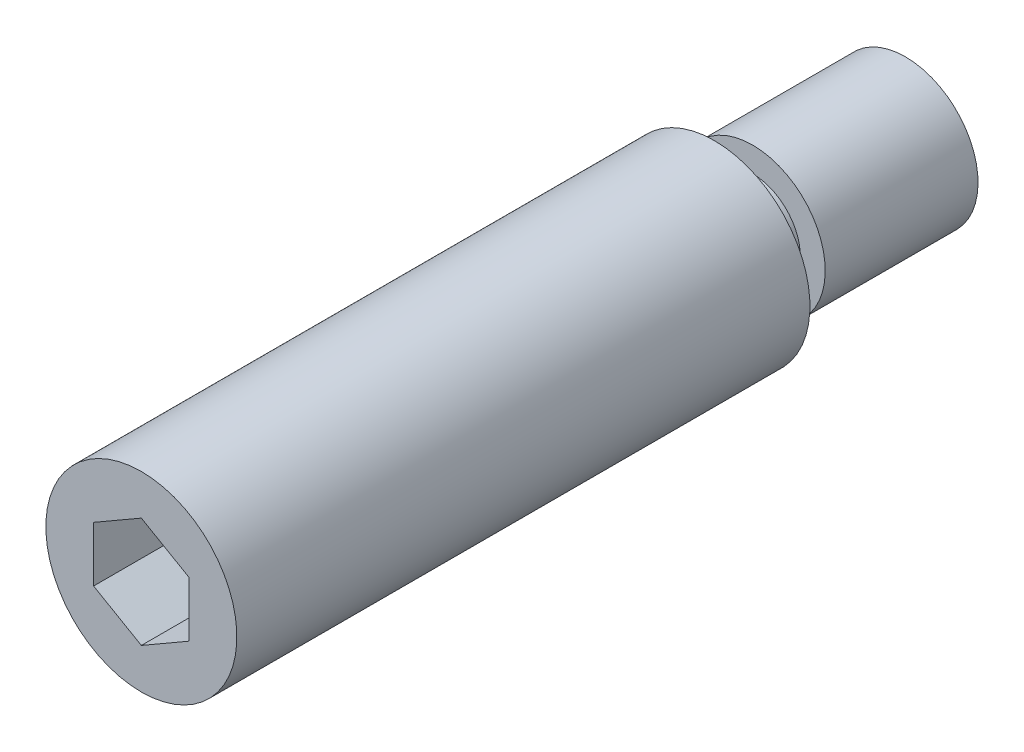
ISO-10303-21;
HEADER;
FILE_DESCRIPTION(('STEP AP214'),'2;1');
FILE_NAME('part.step','',(''),(''),'','','');
FILE_SCHEMA(('AUTOMOTIVE_DESIGN { 1 0 10303 214 1 1 1 1 }'));
ENDSEC;
DATA;
#1=APPLICATION_CONTEXT('core data for automotive mechanical design processes');
#2=APPLICATION_PROTOCOL_DEFINITION('international standard','automotive_design',2000,#1);
#3=PRODUCT_CONTEXT('',#1,'mechanical');
#4=PRODUCT('Part','Part','',(#3));
#5=PRODUCT_RELATED_PRODUCT_CATEGORY('part','',(#4));
#6=PRODUCT_DEFINITION_FORMATION('','',#4);
#7=PRODUCT_DEFINITION_CONTEXT('part definition',#1,'design');
#8=PRODUCT_DEFINITION('design','',#6,#7);
#9=PRODUCT_DEFINITION_SHAPE('','',#8);
#10=(LENGTH_UNIT() NAMED_UNIT(*) SI_UNIT(.MILLI.,.METRE.));
#11=(NAMED_UNIT(*) PLANE_ANGLE_UNIT() SI_UNIT($,.RADIAN.));
#12=(NAMED_UNIT(*) SI_UNIT($,.STERADIAN.) SOLID_ANGLE_UNIT());
#13=UNCERTAINTY_MEASURE_WITH_UNIT(LENGTH_MEASURE(1.E-05),#10,'distance_accuracy_value','');
#14=(GEOMETRIC_REPRESENTATION_CONTEXT(3) GLOBAL_UNCERTAINTY_ASSIGNED_CONTEXT((#13)) GLOBAL_UNIT_ASSIGNED_CONTEXT((#10,
#11,#12)) REPRESENTATION_CONTEXT('',''));
#15=CARTESIAN_POINT('',(0.,0.,0.));
#16=DIRECTION('',(0.,0.,1.));
#17=DIRECTION('',(1.,0.,0.));
#18=AXIS2_PLACEMENT_3D('',#15,#16,#17);
#19=CARTESIAN_POINT('',(0.,-5.,10.));
#20=DIRECTION('',(0.,0.,-1.));
#21=DIRECTION('',(0.,-1.,0.));
#22=AXIS2_PLACEMENT_3D('',#19,#20,#21);
#23=PLANE('',#22);
#24=CARTESIAN_POINT('',(0.,0.,10.));
#25=DIRECTION('',(0.,0.,1.));
#26=DIRECTION('',(0.,1.,0.));
#27=AXIS2_PLACEMENT_3D('',#24,#25,#26);
#28=CIRCLE('',#27,2.5);
#29=CARTESIAN_POINT('',(0.,2.5,10.));
#30=VERTEX_POINT('',#29);
#31=EDGE_CURVE('E115',#30,#30,#28,.T.);
#32=ORIENTED_EDGE('',*,*,#31,.T.);
#33=EDGE_LOOP('',(#32));
#34=FACE_BOUND('',#33,.T.);
#35=CARTESIAN_POINT('',(0.,0.,10.));
#36=DIRECTION('',(0.,0.,1.));
#37=DIRECTION('',(0.,1.,0.));
#38=AXIS2_PLACEMENT_3D('',#35,#36,#37);
#39=CIRCLE('',#38,5.);
#40=CARTESIAN_POINT('',(0.,5.,10.));
#41=VERTEX_POINT('',#40);
#42=EDGE_CURVE('E9',#41,#41,#39,.T.);
#43=ORIENTED_EDGE('',*,*,#42,.F.);
#44=EDGE_LOOP('',(#43));
#45=FACE_BOUND('',#44,.T.);
#46=ADVANCED_FACE('F14',(#34,#45),#23,.T.);
#47=CARTESIAN_POINT('',(0.,0.,20.));
#48=DIRECTION('',(0.,0.,1.));
#49=DIRECTION('',(0.,1.,0.));
#50=AXIS2_PLACEMENT_3D('',#47,#48,#49);
#51=CYLINDRICAL_SURFACE('',#50,5.);
#52=CARTESIAN_POINT('',(0.,0.,40.));
#53=DIRECTION('',(0.,0.,1.));
#54=DIRECTION('',(0.,1.,0.));
#55=AXIS2_PLACEMENT_3D('',#52,#53,#54);
#56=CIRCLE('',#55,5.);
#57=CARTESIAN_POINT('',(0.,5.,40.));
#58=VERTEX_POINT('',#57);
#59=EDGE_CURVE('E21',#58,#58,#56,.T.);
#60=ORIENTED_EDGE('',*,*,#59,.F.);
#61=EDGE_LOOP('',(#60));
#62=FACE_BOUND('',#61,.T.);
#63=ORIENTED_EDGE('',*,*,#42,.T.);
#64=EDGE_LOOP('',(#63));
#65=FACE_BOUND('',#64,.T.);
#66=ADVANCED_FACE('F136',(#62,#65),#51,.T.);
#67=CARTESIAN_POINT('',(0.,-5.,40.));
#68=DIRECTION('',(0.,0.,-1.));
#69=DIRECTION('',(0.,-1.,0.));
#70=AXIS2_PLACEMENT_3D('',#67,#68,#69);
#71=PLANE('',#70);
#72=DIRECTION('',(-0.866025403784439,-0.5,0.));
#73=VECTOR('',#72,1.);
#74=CARTESIAN_POINT('',(0.,2.88675134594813,40.));
#75=LINE('',#74,#73);
#76=CARTESIAN_POINT('',(0.,2.88675134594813,40.));
#77=VERTEX_POINT('',#76);
#78=CARTESIAN_POINT('',(-2.5,1.44337567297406,40.));
#79=VERTEX_POINT('',#78);
#80=EDGE_CURVE('E102',#77,#79,#75,.T.);
#81=ORIENTED_EDGE('',*,*,#80,.F.);
#82=DIRECTION('',(-0.866025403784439,0.5,0.));
#83=VECTOR('',#82,1.);
#84=CARTESIAN_POINT('',(2.5,1.44337567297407,40.));
#85=LINE('',#84,#83);
#86=CARTESIAN_POINT('',(2.5,1.44337567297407,40.));
#87=VERTEX_POINT('',#86);
#88=EDGE_CURVE('E28',#87,#77,#85,.T.);
#89=ORIENTED_EDGE('',*,*,#88,.F.);
#90=DIRECTION('',(0.,1.,0.));
#91=VECTOR('',#90,1.);
#92=CARTESIAN_POINT('',(2.5,-1.44337567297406,40.));
#93=LINE('',#92,#91);
#94=CARTESIAN_POINT('',(2.5,-1.44337567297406,40.));
#95=VERTEX_POINT('',#94);
#96=EDGE_CURVE('E111',#95,#87,#93,.T.);
#97=ORIENTED_EDGE('',*,*,#96,.F.);
#98=DIRECTION('',(0.866025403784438,0.5,0.));
#99=VECTOR('',#98,1.);
#100=CARTESIAN_POINT('',(0.,-2.88675134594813,40.));
#101=LINE('',#100,#99);
#102=CARTESIAN_POINT('',(0.,-2.88675134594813,40.));
#103=VERTEX_POINT('',#102);
#104=EDGE_CURVE('E109',#103,#95,#101,.T.);
#105=ORIENTED_EDGE('',*,*,#104,.F.);
#106=DIRECTION('',(0.866025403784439,-0.5,0.));
#107=VECTOR('',#106,1.);
#108=CARTESIAN_POINT('',(-2.5,-1.44337567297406,40.));
#109=LINE('',#108,#107);
#110=CARTESIAN_POINT('',(-2.5,-1.44337567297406,40.));
#111=VERTEX_POINT('',#110);
#112=EDGE_CURVE('E76',#111,#103,#109,.T.);
#113=ORIENTED_EDGE('',*,*,#112,.F.);
#114=DIRECTION('',(0.,-1.,0.));
#115=VECTOR('',#114,1.);
#116=CARTESIAN_POINT('',(-2.5,1.44337567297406,40.));
#117=LINE('',#116,#115);
#118=EDGE_CURVE('E105',#79,#111,#117,.T.);
#119=ORIENTED_EDGE('',*,*,#118,.F.);
#120=EDGE_LOOP('',(#81,#89,#97,#105,#113,#119));
#121=FACE_BOUND('',#120,.T.);
#122=ORIENTED_EDGE('',*,*,#59,.T.);
#123=EDGE_LOOP('',(#122));
#124=FACE_BOUND('',#123,.T.);
#125=ADVANCED_FACE('F134',(#121,#124),#71,.F.);
#126=CARTESIAN_POINT('',(0.,-3.8,0.));
#127=DIRECTION('',(0.,0.,-1.));
#128=DIRECTION('',(0.,-1.,0.));
#129=AXIS2_PLACEMENT_3D('',#126,#127,#128);
#130=PLANE('',#129);
#131=CARTESIAN_POINT('',(0.,0.,0.));
#132=DIRECTION('',(0.,0.,1.));
#133=DIRECTION('',(0.,1.,0.));
#134=AXIS2_PLACEMENT_3D('',#131,#132,#133);
#135=CIRCLE('',#134,3.8);
#136=CARTESIAN_POINT('',(0.,3.8,0.));
#137=VERTEX_POINT('',#136);
#138=EDGE_CURVE('E129',#137,#137,#135,.T.);
#139=ORIENTED_EDGE('',*,*,#138,.F.);
#140=EDGE_LOOP('',(#139));
#141=FACE_BOUND('',#140,.T.);
#142=ADVANCED_FACE('F167',(#141),#130,.T.);
#143=CARTESIAN_POINT('',(0.,0.,20.));
#144=DIRECTION('',(0.,0.,1.));
#145=DIRECTION('',(0.,1.,0.));
#146=AXIS2_PLACEMENT_3D('',#143,#144,#145);
#147=CYLINDRICAL_SURFACE('',#146,3.8);
#148=ORIENTED_EDGE('',*,*,#138,.T.);
#149=EDGE_LOOP('',(#148));
#150=FACE_BOUND('',#149,.T.);
#151=CARTESIAN_POINT('',(0.,0.,8.));
#152=DIRECTION('',(0.,0.,1.));
#153=DIRECTION('',(0.,1.,0.));
#154=AXIS2_PLACEMENT_3D('',#151,#152,#153);
#155=CIRCLE('',#154,3.8);
#156=CARTESIAN_POINT('',(0.,3.8,8.));
#157=VERTEX_POINT('',#156);
#158=EDGE_CURVE('E126',#157,#157,#155,.T.);
#159=ORIENTED_EDGE('',*,*,#158,.F.);
#160=EDGE_LOOP('',(#159));
#161=FACE_BOUND('',#160,.T.);
#162=ADVANCED_FACE('F160',(#150,#161),#147,.T.);
#163=CARTESIAN_POINT('',(0.,-2.5,8.));
#164=DIRECTION('',(0.,0.,1.));
#165=DIRECTION('',(0.,1.,0.));
#166=AXIS2_PLACEMENT_3D('',#163,#164,#165);
#167=PLANE('',#166);
#168=ORIENTED_EDGE('',*,*,#158,.T.);
#169=EDGE_LOOP('',(#168));
#170=FACE_BOUND('',#169,.T.);
#171=CARTESIAN_POINT('',(0.,0.,8.));
#172=DIRECTION('',(0.,0.,1.));
#173=DIRECTION('',(0.,1.,0.));
#174=AXIS2_PLACEMENT_3D('',#171,#172,#173);
#175=CIRCLE('',#174,2.5);
#176=CARTESIAN_POINT('',(0.,2.5,8.));
#177=VERTEX_POINT('',#176);
#178=EDGE_CURVE('E123',#177,#177,#175,.T.);
#179=ORIENTED_EDGE('',*,*,#178,.F.);
#180=EDGE_LOOP('',(#179));
#181=FACE_BOUND('',#180,.T.);
#182=ADVANCED_FACE('F151',(#170,#181),#167,.T.);
#183=CARTESIAN_POINT('',(0.,0.,20.));
#184=DIRECTION('',(0.,0.,1.));
#185=DIRECTION('',(0.,1.,0.));
#186=AXIS2_PLACEMENT_3D('',#183,#184,#185);
#187=CYLINDRICAL_SURFACE('',#186,2.5);
#188=ORIENTED_EDGE('',*,*,#178,.T.);
#189=EDGE_LOOP('',(#188));
#190=FACE_BOUND('',#189,.T.);
#191=ORIENTED_EDGE('',*,*,#31,.F.);
#192=EDGE_LOOP('',(#191));
#193=FACE_BOUND('',#192,.T.);
#194=ADVANCED_FACE('F148',(#190,#193),#187,.T.);
#195=CARTESIAN_POINT('',(2.5,1.44337567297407,34.));
#196=DIRECTION('',(0.5,0.866025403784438,0.));
#197=DIRECTION('',(-0.866025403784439,0.5,0.));
#198=AXIS2_PLACEMENT_3D('',#195,#196,#197);
#199=PLANE('',#198);
#200=ORIENTED_EDGE('',*,*,#88,.T.);
#201=DIRECTION('',(0.,0.,1.));
#202=VECTOR('',#201,1.);
#203=CARTESIAN_POINT('',(0.,2.88675134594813,34.));
#204=LINE('',#203,#202);
#205=CARTESIAN_POINT('',(0.,2.88675134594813,34.));
#206=VERTEX_POINT('',#205);
#207=EDGE_CURVE('E58',#206,#77,#204,.T.);
#208=ORIENTED_EDGE('',*,*,#207,.F.);
#209=DIRECTION('',(-0.866025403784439,0.5,0.));
#210=VECTOR('',#209,1.);
#211=CARTESIAN_POINT('',(2.5,1.44337567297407,34.));
#212=LINE('',#211,#210);
#213=CARTESIAN_POINT('',(2.5,1.44337567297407,34.));
#214=VERTEX_POINT('',#213);
#215=EDGE_CURVE('E113',#214,#206,#212,.T.);
#216=ORIENTED_EDGE('',*,*,#215,.F.);
#217=DIRECTION('',(0.,0.,1.));
#218=VECTOR('',#217,1.);
#219=CARTESIAN_POINT('',(2.5,1.44337567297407,34.));
#220=LINE('',#219,#218);
#221=EDGE_CURVE('E36',#214,#87,#220,.T.);
#222=ORIENTED_EDGE('',*,*,#221,.T.);
#223=EDGE_LOOP('',(#200,#208,#216,#222));
#224=FACE_BOUND('',#223,.T.);
#225=ADVANCED_FACE('F150',(#224),#199,.F.);
#226=CARTESIAN_POINT('',(2.5,-1.44337567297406,34.));
#227=DIRECTION('',(1.,0.,0.));
#228=DIRECTION('',(0.,0.,-1.));
#229=AXIS2_PLACEMENT_3D('',#226,#227,#228);
#230=PLANE('',#229);
#231=ORIENTED_EDGE('',*,*,#96,.T.);
#232=ORIENTED_EDGE('',*,*,#221,.F.);
#233=DIRECTION('',(0.,1.,0.));
#234=VECTOR('',#233,1.);
#235=CARTESIAN_POINT('',(2.5,-1.44337567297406,34.));
#236=LINE('',#235,#234);
#237=CARTESIAN_POINT('',(2.5,-1.44337567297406,34.));
#238=VERTEX_POINT('',#237);
#239=EDGE_CURVE('E88',#238,#214,#236,.T.);
#240=ORIENTED_EDGE('',*,*,#239,.F.);
#241=DIRECTION('',(0.,0.,1.));
#242=VECTOR('',#241,1.);
#243=CARTESIAN_POINT('',(2.5,-1.44337567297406,34.));
#244=LINE('',#243,#242);
#245=EDGE_CURVE('E80',#238,#95,#244,.T.);
#246=ORIENTED_EDGE('',*,*,#245,.T.);
#247=EDGE_LOOP('',(#231,#232,#240,#246));
#248=FACE_BOUND('',#247,.T.);
#249=ADVANCED_FACE('F158',(#248),#230,.F.);
#250=CARTESIAN_POINT('',(0.,-2.88675134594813,34.));
#251=DIRECTION('',(0.5,-0.866025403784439,0.));
#252=DIRECTION('',(0.866025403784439,0.5,0.));
#253=AXIS2_PLACEMENT_3D('',#250,#251,#252);
#254=PLANE('',#253);
#255=ORIENTED_EDGE('',*,*,#104,.T.);
#256=ORIENTED_EDGE('',*,*,#245,.F.);
#257=DIRECTION('',(0.866025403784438,0.5,0.));
#258=VECTOR('',#257,1.);
#259=CARTESIAN_POINT('',(0.,-2.88675134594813,34.));
#260=LINE('',#259,#258);
#261=CARTESIAN_POINT('',(0.,-2.88675134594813,34.));
#262=VERTEX_POINT('',#261);
#263=EDGE_CURVE('E84',#262,#238,#260,.T.);
#264=ORIENTED_EDGE('',*,*,#263,.F.);
#265=DIRECTION('',(0.,0.,1.));
#266=VECTOR('',#265,1.);
#267=CARTESIAN_POINT('',(0.,-2.88675134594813,34.));
#268=LINE('',#267,#266);
#269=EDGE_CURVE('E69',#262,#103,#268,.T.);
#270=ORIENTED_EDGE('',*,*,#269,.T.);
#271=EDGE_LOOP('',(#255,#256,#264,#270));
#272=FACE_BOUND('',#271,.T.);
#273=ADVANCED_FACE('F85',(#272),#254,.F.);
#274=CARTESIAN_POINT('',(-2.5,-1.44337567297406,34.));
#275=DIRECTION('',(-0.5,-0.866025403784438,0.));
#276=DIRECTION('',(0.866025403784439,-0.5,0.));
#277=AXIS2_PLACEMENT_3D('',#274,#275,#276);
#278=PLANE('',#277);
#279=ORIENTED_EDGE('',*,*,#112,.T.);
#280=ORIENTED_EDGE('',*,*,#269,.F.);
#281=DIRECTION('',(0.866025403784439,-0.5,0.));
#282=VECTOR('',#281,1.);
#283=CARTESIAN_POINT('',(-2.5,-1.44337567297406,34.));
#284=LINE('',#283,#282);
#285=CARTESIAN_POINT('',(-2.5,-1.44337567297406,34.));
#286=VERTEX_POINT('',#285);
#287=EDGE_CURVE('E73',#286,#262,#284,.T.);
#288=ORIENTED_EDGE('',*,*,#287,.F.);
#289=DIRECTION('',(0.,0.,1.));
#290=VECTOR('',#289,1.);
#291=CARTESIAN_POINT('',(-2.5,-1.44337567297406,34.));
#292=LINE('',#291,#290);
#293=EDGE_CURVE('E81',#286,#111,#292,.T.);
#294=ORIENTED_EDGE('',*,*,#293,.T.);
#295=EDGE_LOOP('',(#279,#280,#288,#294));
#296=FACE_BOUND('',#295,.T.);
#297=ADVANCED_FACE('F71',(#296),#278,.F.);
#298=CARTESIAN_POINT('',(-2.5,1.44337567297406,34.));
#299=DIRECTION('',(-1.,0.,0.));
#300=DIRECTION('',(0.,-1.,0.));
#301=AXIS2_PLACEMENT_3D('',#298,#299,#300);
#302=PLANE('',#301);
#303=ORIENTED_EDGE('',*,*,#118,.T.);
#304=ORIENTED_EDGE('',*,*,#293,.F.);
#305=DIRECTION('',(0.,-1.,0.));
#306=VECTOR('',#305,1.);
#307=CARTESIAN_POINT('',(-2.5,1.44337567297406,34.));
#308=LINE('',#307,#306);
#309=CARTESIAN_POINT('',(-2.5,1.44337567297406,34.));
#310=VERTEX_POINT('',#309);
#311=EDGE_CURVE('E94',#310,#286,#308,.T.);
#312=ORIENTED_EDGE('',*,*,#311,.F.);
#313=DIRECTION('',(0.,0.,1.));
#314=VECTOR('',#313,1.);
#315=CARTESIAN_POINT('',(-2.5,1.44337567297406,34.));
#316=LINE('',#315,#314);
#317=EDGE_CURVE('E118',#310,#79,#316,.T.);
#318=ORIENTED_EDGE('',*,*,#317,.T.);
#319=EDGE_LOOP('',(#303,#304,#312,#318));
#320=FACE_BOUND('',#319,.T.);
#321=ADVANCED_FACE('F192',(#320),#302,.F.);
#322=CARTESIAN_POINT('',(0.,2.88675134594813,34.));
#323=DIRECTION('',(-0.5,0.866025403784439,0.));
#324=DIRECTION('',(-0.866025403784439,-0.5,0.));
#325=AXIS2_PLACEMENT_3D('',#322,#323,#324);
#326=PLANE('',#325);
#327=ORIENTED_EDGE('',*,*,#80,.T.);
#328=ORIENTED_EDGE('',*,*,#317,.F.);
#329=DIRECTION('',(-0.866025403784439,-0.5,0.));
#330=VECTOR('',#329,1.);
#331=CARTESIAN_POINT('',(0.,2.88675134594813,34.));
#332=LINE('',#331,#330);
#333=EDGE_CURVE('E96',#206,#310,#332,.T.);
#334=ORIENTED_EDGE('',*,*,#333,.F.);
#335=ORIENTED_EDGE('',*,*,#207,.T.);
#336=EDGE_LOOP('',(#327,#328,#334,#335));
#337=FACE_BOUND('',#336,.T.);
#338=ADVANCED_FACE('F180',(#337),#326,.F.);
#339=CARTESIAN_POINT('',(0.,2.88675134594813,34.));
#340=DIRECTION('',(0.,0.,1.));
#341=DIRECTION('',(1.,0.,0.));
#342=AXIS2_PLACEMENT_3D('',#339,#340,#341);
#343=PLANE('',#342);
#344=ORIENTED_EDGE('',*,*,#215,.T.);
#345=ORIENTED_EDGE('',*,*,#333,.T.);
#346=ORIENTED_EDGE('',*,*,#311,.T.);
#347=ORIENTED_EDGE('',*,*,#287,.T.);
#348=ORIENTED_EDGE('',*,*,#263,.T.);
#349=ORIENTED_EDGE('',*,*,#239,.T.);
#350=EDGE_LOOP('',(#344,#345,#346,#347,#348,#349));
#351=FACE_BOUND('',#350,.T.);
#352=ADVANCED_FACE('F91',(#351),#343,.T.);
#353=CLOSED_SHELL('',(#46,#66,#125,#142,#162,#182,#194,#225,#249,#273,#297,#321,#338,#352));
#354=MANIFOLD_SOLID_BREP('B1',#353);
#355=ADVANCED_BREP_SHAPE_REPRESENTATION('',(#18,#354),#14);
#356=SHAPE_DEFINITION_REPRESENTATION(#9,#355);
ENDSEC;
END-ISO-10303-21;
